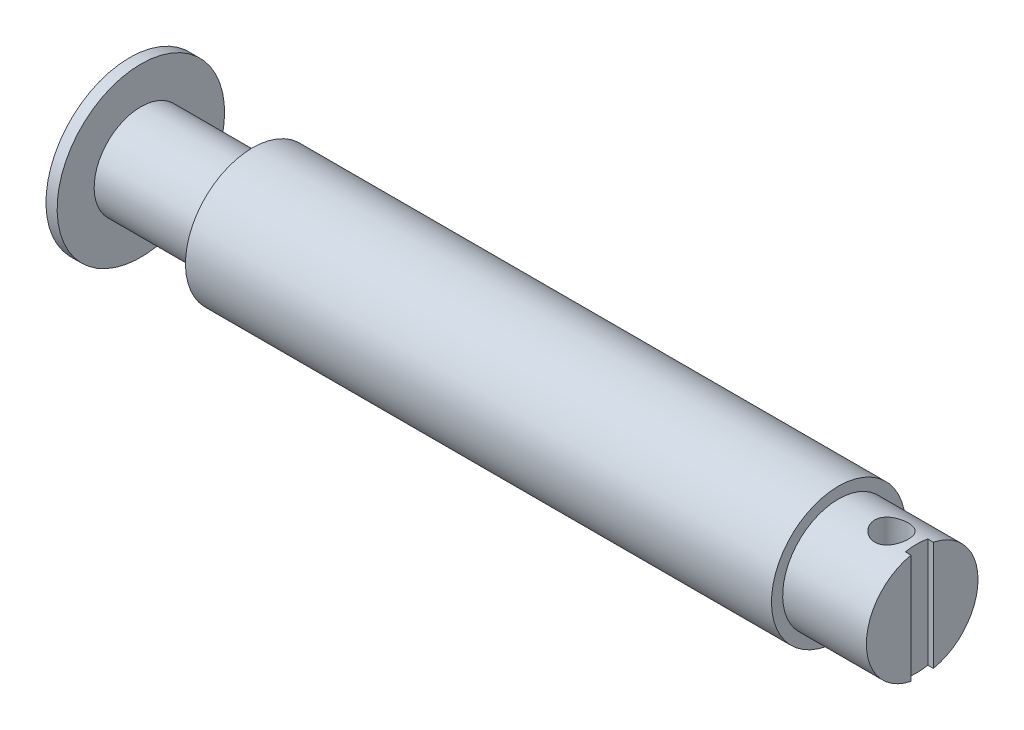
ISO-10303-21;
HEADER;
FILE_DESCRIPTION(('STEP AP214'),'2;1');
FILE_NAME('part.step','',(''),(''),'','','');
FILE_SCHEMA(('AUTOMOTIVE_DESIGN { 1 0 10303 214 1 1 1 1 }'));
ENDSEC;
DATA;
#1=APPLICATION_CONTEXT('core data for automotive mechanical design processes');
#2=APPLICATION_PROTOCOL_DEFINITION('international standard','automotive_design',2000,#1);
#3=PRODUCT_CONTEXT('',#1,'mechanical');
#4=PRODUCT('Part','Part','',(#3));
#5=PRODUCT_RELATED_PRODUCT_CATEGORY('part','',(#4));
#6=PRODUCT_DEFINITION_FORMATION('','',#4);
#7=PRODUCT_DEFINITION_CONTEXT('part definition',#1,'design');
#8=PRODUCT_DEFINITION('design','',#6,#7);
#9=PRODUCT_DEFINITION_SHAPE('','',#8);
#10=(LENGTH_UNIT() NAMED_UNIT(*) SI_UNIT(.MILLI.,.METRE.));
#11=(NAMED_UNIT(*) PLANE_ANGLE_UNIT() SI_UNIT($,.RADIAN.));
#12=(NAMED_UNIT(*) SI_UNIT($,.STERADIAN.) SOLID_ANGLE_UNIT());
#13=UNCERTAINTY_MEASURE_WITH_UNIT(LENGTH_MEASURE(1.E-05),#10,'distance_accuracy_value','');
#14=(GEOMETRIC_REPRESENTATION_CONTEXT(3) GLOBAL_UNCERTAINTY_ASSIGNED_CONTEXT((#13)) GLOBAL_UNIT_ASSIGNED_CONTEXT((#10,
#11,#12)) REPRESENTATION_CONTEXT('',''));
#15=CARTESIAN_POINT('',(0.,0.,0.));
#16=DIRECTION('',(0.,0.,1.));
#17=DIRECTION('',(1.,0.,0.));
#18=AXIS2_PLACEMENT_3D('',#15,#16,#17);
#19=CARTESIAN_POINT('',(87.,2.70021046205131E-13,0.));
#20=DIRECTION('',(1.,0.,0.));
#21=DIRECTION('',(0.,1.,0.));
#22=AXIS2_PLACEMENT_3D('',#19,#20,#21);
#23=PLANE('',#22);
#24=CARTESIAN_POINT('',(87.,2.70021046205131E-13,0.));
#25=DIRECTION('',(1.,0.,0.));
#26=DIRECTION('',(0.,1.,0.));
#27=AXIS2_PLACEMENT_3D('',#24,#25,#26);
#28=CIRCLE('',#27,9.99999999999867);
#29=CARTESIAN_POINT('',(87.,9.79795897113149,-2.));
#30=VERTEX_POINT('',#29);
#31=CARTESIAN_POINT('',(87.,9.79795897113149,2.));
#32=VERTEX_POINT('',#31);
#33=EDGE_CURVE('E102',#30,#32,#28,.T.);
#34=ORIENTED_EDGE('',*,*,#33,.T.);
#35=DIRECTION('',(0.,1.,0.));
#36=VECTOR('',#35,1.);
#37=CARTESIAN_POINT('',(87.,9.79795897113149,2.));
#38=LINE('',#37,#36);
#39=CARTESIAN_POINT('',(87.,-9.79795897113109,2.));
#40=VERTEX_POINT('',#39);
#41=EDGE_CURVE('E86',#40,#32,#38,.T.);
#42=ORIENTED_EDGE('',*,*,#41,.F.);
#43=CARTESIAN_POINT('',(87.,-9.79795897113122,-2.));
#44=VERTEX_POINT('',#43);
#45=EDGE_CURVE('E108',#40,#44,#28,.T.);
#46=ORIENTED_EDGE('',*,*,#45,.T.);
#47=DIRECTION('',(0.,1.,0.));
#48=VECTOR('',#47,1.);
#49=CARTESIAN_POINT('',(87.,-9.79795897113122,-2.));
#50=LINE('',#49,#48);
#51=EDGE_CURVE('E107',#44,#30,#50,.T.);
#52=ORIENTED_EDGE('',*,*,#51,.T.);
#53=EDGE_LOOP('',(#34,#42,#46,#52));
#54=FACE_BOUND('',#53,.T.);
#55=ADVANCED_FACE('F42',(#54),#23,.T.);
#56=CARTESIAN_POINT('',(73.,2.70616862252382E-13,0.));
#57=DIRECTION('',(1.,0.,0.));
#58=DIRECTION('',(0.,1.,0.));
#59=AXIS2_PLACEMENT_3D('',#56,#57,#58);
#60=PLANE('',#59);
#61=CARTESIAN_POINT('',(73.,2.70616862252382E-13,0.));
#62=DIRECTION('',(1.,0.,0.));
#63=DIRECTION('',(0.,1.,0.));
#64=AXIS2_PLACEMENT_3D('',#61,#62,#63);
#65=CIRCLE('',#64,12.);
#66=CARTESIAN_POINT('',(73.,12.0000000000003,0.));
#67=VERTEX_POINT('',#66);
#68=EDGE_CURVE('E137',#67,#67,#65,.T.);
#69=ORIENTED_EDGE('',*,*,#68,.T.);
#70=EDGE_LOOP('',(#69));
#71=FACE_BOUND('',#70,.T.);
#72=CARTESIAN_POINT('',(73.,2.70025701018E-13,0.));
#73=DIRECTION('',(1.,0.,0.));
#74=DIRECTION('',(0.,1.,0.));
#75=AXIS2_PLACEMENT_3D('',#72,#73,#74);
#76=CIRCLE('',#75,10.);
#77=CARTESIAN_POINT('',(73.,10.0000000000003,0.));
#78=VERTEX_POINT('',#77);
#79=EDGE_CURVE('E117',#78,#78,#76,.T.);
#80=ORIENTED_EDGE('',*,*,#79,.F.);
#81=EDGE_LOOP('',(#80));
#82=FACE_BOUND('',#81,.T.);
#83=ADVANCED_FACE('F166',(#71,#82),#60,.T.);
#84=CARTESIAN_POINT('',(-54.,2.70025701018E-13,0.));
#85=DIRECTION('',(1.,0.,0.));
#86=DIRECTION('',(0.,1.,0.));
#87=AXIS2_PLACEMENT_3D('',#84,#85,#86);
#88=CYLINDRICAL_SURFACE('',#87,15.);
#89=CARTESIAN_POINT('',(-54.,2.70025701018E-13,0.));
#90=DIRECTION('',(1.,0.,0.));
#91=DIRECTION('',(0.,1.,0.));
#92=AXIS2_PLACEMENT_3D('',#89,#90,#91);
#93=CIRCLE('',#92,15.);
#94=CARTESIAN_POINT('',(-54.,15.0000000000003,0.));
#95=VERTEX_POINT('',#94);
#96=EDGE_CURVE('E143',#95,#95,#93,.T.);
#97=ORIENTED_EDGE('',*,*,#96,.T.);
#98=EDGE_LOOP('',(#97));
#99=FACE_BOUND('',#98,.T.);
#100=CARTESIAN_POINT('',(-52.,2.70035010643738E-13,0.));
#101=DIRECTION('',(1.,0.,0.));
#102=DIRECTION('',(0.,1.,0.));
#103=AXIS2_PLACEMENT_3D('',#100,#101,#102);
#104=CIRCLE('',#103,15.);
#105=CARTESIAN_POINT('',(-52.,15.0000000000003,0.));
#106=VERTEX_POINT('',#105);
#107=EDGE_CURVE('E124',#106,#106,#104,.T.);
#108=ORIENTED_EDGE('',*,*,#107,.F.);
#109=EDGE_LOOP('',(#108));
#110=FACE_BOUND('',#109,.T.);
#111=ADVANCED_FACE('F44',(#99,#110),#88,.T.);
#112=CARTESIAN_POINT('',(-54.,15.0000000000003,0.));
#113=DIRECTION('',(-1.,0.,0.));
#114=DIRECTION('',(0.,-1.,0.));
#115=AXIS2_PLACEMENT_3D('',#112,#113,#114);
#116=PLANE('',#115);
#117=ORIENTED_EDGE('',*,*,#96,.F.);
#118=EDGE_LOOP('',(#117));
#119=FACE_BOUND('',#118,.T.);
#120=ADVANCED_FACE('F201',(#119),#116,.T.);
#121=CARTESIAN_POINT('',(-54.,2.70025701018E-13,0.));
#122=DIRECTION('',(1.,0.,0.));
#123=DIRECTION('',(0.,1.,0.));
#124=AXIS2_PLACEMENT_3D('',#121,#122,#123);
#125=CYLINDRICAL_SURFACE('',#124,12.);
#126=CARTESIAN_POINT('',(-32.,2.70128106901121E-13,0.));
#127=DIRECTION('',(1.,0.,0.));
#128=DIRECTION('',(0.,1.,0.));
#129=AXIS2_PLACEMENT_3D('',#126,#127,#128);
#130=CIRCLE('',#129,12.);
#131=CARTESIAN_POINT('',(-32.,12.0000000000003,0.));
#132=VERTEX_POINT('',#131);
#133=EDGE_CURVE('E132',#132,#132,#130,.T.);
#134=ORIENTED_EDGE('',*,*,#133,.T.);
#135=EDGE_LOOP('',(#134));
#136=FACE_BOUND('',#135,.T.);
#137=ORIENTED_EDGE('',*,*,#68,.F.);
#138=EDGE_LOOP('',(#137));
#139=FACE_BOUND('',#138,.T.);
#140=ADVANCED_FACE('F197',(#136,#139),#125,.T.);
#141=CARTESIAN_POINT('',(-32.,12.0000000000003,0.));
#142=DIRECTION('',(-1.,0.,0.));
#143=DIRECTION('',(0.,-1.,0.));
#144=AXIS2_PLACEMENT_3D('',#141,#142,#143);
#145=PLANE('',#144);
#146=CARTESIAN_POINT('',(-32.,2.70128106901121E-13,0.));
#147=DIRECTION('',(1.,0.,0.));
#148=DIRECTION('',(0.,1.,0.));
#149=AXIS2_PLACEMENT_3D('',#146,#147,#148);
#150=CIRCLE('',#149,8.36463737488);
#151=CARTESIAN_POINT('',(-32.,8.36463737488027,0.));
#152=VERTEX_POINT('',#151);
#153=EDGE_CURVE('E130',#152,#152,#150,.T.);
#154=ORIENTED_EDGE('',*,*,#153,.T.);
#155=EDGE_LOOP('',(#154));
#156=FACE_BOUND('',#155,.T.);
#157=ORIENTED_EDGE('',*,*,#133,.F.);
#158=EDGE_LOOP('',(#157));
#159=FACE_BOUND('',#158,.T.);
#160=ADVANCED_FACE('F190',(#156,#159),#145,.T.);
#161=CARTESIAN_POINT('',(-54.,2.70025701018E-13,0.));
#162=DIRECTION('',(1.,0.,0.));
#163=DIRECTION('',(0.,1.,0.));
#164=AXIS2_PLACEMENT_3D('',#161,#162,#163);
#165=CYLINDRICAL_SURFACE('',#164,8.36463737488);
#166=CARTESIAN_POINT('',(-52.,2.70035010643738E-13,0.));
#167=DIRECTION('',(1.,0.,0.));
#168=DIRECTION('',(0.,1.,0.));
#169=AXIS2_PLACEMENT_3D('',#166,#167,#168);
#170=CIRCLE('',#169,8.36463737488);
#171=CARTESIAN_POINT('',(-52.,8.36463737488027,0.));
#172=VERTEX_POINT('',#171);
#173=EDGE_CURVE('E127',#172,#172,#170,.T.);
#174=ORIENTED_EDGE('',*,*,#173,.T.);
#175=EDGE_LOOP('',(#174));
#176=FACE_BOUND('',#175,.T.);
#177=ORIENTED_EDGE('',*,*,#153,.F.);
#178=EDGE_LOOP('',(#177));
#179=FACE_BOUND('',#178,.T.);
#180=ADVANCED_FACE('F181',(#176,#179),#165,.T.);
#181=CARTESIAN_POINT('',(-52.,8.36463737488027,0.));
#182=DIRECTION('',(1.,0.,0.));
#183=DIRECTION('',(0.,1.,0.));
#184=AXIS2_PLACEMENT_3D('',#181,#182,#183);
#185=PLANE('',#184);
#186=ORIENTED_EDGE('',*,*,#107,.T.);
#187=EDGE_LOOP('',(#186));
#188=FACE_BOUND('',#187,.T.);
#189=ORIENTED_EDGE('',*,*,#173,.F.);
#190=EDGE_LOOP('',(#189));
#191=FACE_BOUND('',#190,.T.);
#192=ADVANCED_FACE('F174',(#188,#191),#185,.T.);
#193=CARTESIAN_POINT('',(88.,2.70095523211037E-13,0.));
#194=DIRECTION('',(-1.,0.,0.));
#195=DIRECTION('',(0.,-1.,0.));
#196=AXIS2_PLACEMENT_3D('',#193,#194,#195);
#197=CYLINDRICAL_SURFACE('',#196,10.);
#198=CARTESIAN_POINT('',(85.5,-9.99999999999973,0.));
#199=CARTESIAN_POINT('',(85.4999980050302,-9.99999858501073,-0.164577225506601));
#200=CARTESIAN_POINT('',(85.4864122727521,-9.9958983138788,-0.32917463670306));
#201=CARTESIAN_POINT('',(85.4325572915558,-9.97994211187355,-0.653576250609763));
#202=CARTESIAN_POINT('',(85.3922800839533,-9.96808386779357,-0.813379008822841));
#203=CARTESIAN_POINT('',(85.2865079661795,-9.93791105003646,-1.12346541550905));
#204=CARTESIAN_POINT('',(85.2210502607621,-9.91960600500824,-1.27376272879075));
#205=CARTESIAN_POINT('',(85.0669278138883,-9.87844218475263,-1.56124836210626));
#206=CARTESIAN_POINT('',(84.9782599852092,-9.85558280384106,-1.69843493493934));
#207=CARTESIAN_POINT('',(84.7775519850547,-9.80701474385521,-1.95974359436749));
#208=CARTESIAN_POINT('',(84.6649667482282,-9.78124767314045,-2.08343614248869));
#209=CARTESIAN_POINT('',(84.4207815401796,-9.73011668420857,-2.31049841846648));
#210=CARTESIAN_POINT('',(84.2891783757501,-9.70475283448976,-2.41386472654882));
#211=CARTESIAN_POINT('',(84.0070584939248,-9.65668227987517,-2.59960075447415));
#212=CARTESIAN_POINT('',(83.8561830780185,-9.63404813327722,-2.68144618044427));
#213=CARTESIAN_POINT('',(83.5420214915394,-9.59487240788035,-2.81842789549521));
#214=CARTESIAN_POINT('',(83.3787383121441,-9.57832936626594,-2.87357059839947));
#215=CARTESIAN_POINT('',(83.0492194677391,-9.55381741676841,-2.95403267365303));
#216=CARTESIAN_POINT('',(82.8831945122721,-9.5456213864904,-2.98014392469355));
#217=CARTESIAN_POINT('',(82.5489336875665,-9.53805579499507,-3.00427461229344));
#218=CARTESIAN_POINT('',(82.3806983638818,-9.53868409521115,-3.00230085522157));
#219=CARTESIAN_POINT('',(82.053232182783,-9.54849488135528,-2.97093954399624));
#220=CARTESIAN_POINT('',(81.8938954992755,-9.55736777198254,-2.94254410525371));
#221=CARTESIAN_POINT('',(81.5823604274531,-9.58216712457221,-2.86074840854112));
#222=CARTESIAN_POINT('',(81.4301627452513,-9.59809428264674,-2.80734568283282));
#223=CARTESIAN_POINT('',(81.1347993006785,-9.63545466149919,-2.67632053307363));
#224=CARTESIAN_POINT('',(80.9917858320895,-9.65696032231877,-2.59837633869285));
#225=CARTESIAN_POINT('',(80.7205359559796,-9.70301974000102,-2.42070445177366));
#226=CARTESIAN_POINT('',(80.5923031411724,-9.72757423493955,-2.32097148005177));
#227=CARTESIAN_POINT('',(80.348627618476,-9.77822022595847,-2.09762581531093));
#228=CARTESIAN_POINT('',(80.2339426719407,-9.80433308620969,-1.97318981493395));
#229=CARTESIAN_POINT('',(80.0268920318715,-9.8542448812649,-1.70652651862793));
#230=CARTESIAN_POINT('',(79.9345277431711,-9.87804367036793,-1.56429810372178));
#231=CARTESIAN_POINT('',(79.7742801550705,-9.92086320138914,-1.26471007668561));
#232=CARTESIAN_POINT('',(79.7065649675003,-9.93985087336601,-1.1072554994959));
#233=CARTESIAN_POINT('',(79.5988008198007,-9.97067043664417,-0.782490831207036));
#234=CARTESIAN_POINT('',(79.558744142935,-9.98250432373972,-0.61518350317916));
#235=CARTESIAN_POINT('',(79.5086956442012,-9.9973672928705,-0.281904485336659));
#236=CARTESIAN_POINT('',(79.4976768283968,-10.0006970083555,-0.11610019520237));
#237=CARTESIAN_POINT('',(79.5031383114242,-9.99905846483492,0.214999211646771));
#238=CARTESIAN_POINT('',(79.5196149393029,-9.99409131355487,0.380294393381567));
#239=CARTESIAN_POINT('',(79.578769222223,-9.97661393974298,0.701807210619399));
#240=CARTESIAN_POINT('',(79.6208467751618,-9.96427659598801,0.858145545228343));
#241=CARTESIAN_POINT('',(79.7292864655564,-9.93348695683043,1.16150927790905));
#242=CARTESIAN_POINT('',(79.7956515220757,-9.91503392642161,1.30853355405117));
#243=CARTESIAN_POINT('',(79.9525063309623,-9.87339308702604,1.59287437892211));
#244=CARTESIAN_POINT('',(80.043518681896,-9.85010561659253,1.72988765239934));
#245=CARTESIAN_POINT('',(80.2464495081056,-9.80146937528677,1.9870466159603));
#246=CARTESIAN_POINT('',(80.3583732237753,-9.77612008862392,2.10718806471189));
#247=CARTESIAN_POINT('',(80.6047746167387,-9.72506343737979,2.33171489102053));
#248=CARTESIAN_POINT('',(80.7399237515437,-9.69937650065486,2.43536962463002));
#249=CARTESIAN_POINT('',(81.0262558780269,-9.65153030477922,2.61857990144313));
#250=CARTESIAN_POINT('',(81.1774384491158,-9.62937095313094,2.69813607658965));
#251=CARTESIAN_POINT('',(81.4910649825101,-9.59134379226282,2.83034694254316));
#252=CARTESIAN_POINT('',(81.6534523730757,-9.57544675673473,2.88312693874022));
#253=CARTESIAN_POINT('',(81.9853759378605,-9.55183188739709,2.96043461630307));
#254=CARTESIAN_POINT('',(82.1549096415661,-9.5441112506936,2.98497197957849));
#255=CARTESIAN_POINT('',(82.4887230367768,-9.53799944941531,3.0044396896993));
#256=CARTESIAN_POINT('',(82.6529273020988,-9.53923294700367,3.00056110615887));
#257=CARTESIAN_POINT('',(82.9782282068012,-9.54998802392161,2.9661501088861));
#258=CARTESIAN_POINT('',(83.139324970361,-9.55950927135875,2.93561876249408));
#259=CARTESIAN_POINT('',(83.4518907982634,-9.58551527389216,2.84953777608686));
#260=CARTESIAN_POINT('',(83.6034545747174,-9.60191209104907,2.79430351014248));
#261=CARTESIAN_POINT('',(83.8952848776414,-9.63980557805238,2.66063014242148));
#262=CARTESIAN_POINT('',(84.0355492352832,-9.66130322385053,2.58218659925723));
#263=CARTESIAN_POINT('',(84.3063262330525,-9.70795352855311,2.40097527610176));
#264=CARTESIAN_POINT('',(84.4362975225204,-9.73321080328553,2.29742552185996));
#265=CARTESIAN_POINT('',(84.6774049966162,-9.78402640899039,2.07034869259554));
#266=CARTESIAN_POINT('',(84.7885362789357,-9.80958481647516,1.94681643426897));
#267=CARTESIAN_POINT('',(84.9920468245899,-9.85901873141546,1.67893152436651));
#268=CARTESIAN_POINT('',(85.083782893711,-9.88282319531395,1.53407577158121));
#269=CARTESIAN_POINT('',(85.2414703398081,-9.92521360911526,1.23028274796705));
#270=CARTESIAN_POINT('',(85.307433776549,-9.94380199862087,1.0713521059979));
#271=CARTESIAN_POINT('',(85.4057905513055,-9.97204349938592,0.761515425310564));
#272=CARTESIAN_POINT('',(85.4410233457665,-9.98244054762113,0.61157392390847));
#273=CARTESIAN_POINT('',(85.4881270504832,-9.99641888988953,0.30776039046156));
#274=CARTESIAN_POINT('',(85.5000018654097,-10.0000013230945,0.15388901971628));
#275=CARTESIAN_POINT('',(85.5,-9.99999999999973,0.));
#276=B_SPLINE_CURVE_WITH_KNOTS('',3,(#198,#199,#200,#201,#202,#203,#204,#205,#206,#207,#208,
#209,#210,#211,#212,#213,#214,#215,#216,#217,#218,#219,#220,#221,#222,#223,#224,#225,#226,#227,
#228,#229,#230,#231,#232,#233,#234,#235,#236,#237,#238,#239,#240,#241,#242,#243,#244,#245,#246,
#247,#248,#249,#250,#251,#252,#253,#254,#255,#256,#257,#258,#259,#260,#261,#262,#263,#264,#265,
#266,#267,#268,#269,#270,#271,#272,#273,#274,#275),.UNSPECIFIED.,.T.,.F.,(4,2,2,2,2,2,2,2,2,2,2,
2,2,2,2,2,2,2,2,2,2,2,2,2,2,2,2,2,2,2,2,2,2,2,2,2,2,2,4),(0.,0.493166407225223,0.986479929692,
1.47906735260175,1.97172032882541,2.47711205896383,2.98258874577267,3.49942962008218,
4.01614629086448,4.51839378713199,5.02051956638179,5.50452033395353,5.98856887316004,
6.4792485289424,6.97004720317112,7.48134208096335,7.99266913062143,8.50742093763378,
9.02202907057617,9.51817618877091,10.0142570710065,10.4991349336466,10.9840710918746,
11.4802261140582,11.9765056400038,12.4908080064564,13.0050968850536,13.5169562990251,
14.0286401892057,14.5190031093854,15.0093463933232,15.4936008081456,15.9779479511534,
16.4799385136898,16.9820594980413,17.4988599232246,18.0154182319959,18.4766338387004,
18.9377723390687),.UNSPECIFIED.);
#277=CARTESIAN_POINT('',(85.5,-9.99999999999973,0.));
#278=VERTEX_POINT('',#277);
#279=EDGE_CURVE('E12',#278,#278,#276,.T.);
#280=ORIENTED_EDGE('',*,*,#279,.T.);
#281=EDGE_LOOP('',(#280));
#282=FACE_BOUND('',#281,.T.);
#283=CARTESIAN_POINT('',(82.5,9.53939201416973,3.));
#284=CARTESIAN_POINT('',(82.3356109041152,9.53939371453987,2.99999795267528));
#285=CARTESIAN_POINT('',(82.171201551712,9.54368780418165,2.98644216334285));
#286=CARTESIAN_POINT('',(81.8471895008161,9.56033156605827,2.93271688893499));
#287=CARTESIAN_POINT('',(81.6875884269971,9.57268392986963,2.89253851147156));
#288=CARTESIAN_POINT('',(81.3779305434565,9.60392204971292,2.78705506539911));
#289=CARTESIAN_POINT('',(81.2278583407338,9.62279693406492,2.72179178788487));
#290=CARTESIAN_POINT('',(80.9407561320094,9.66493865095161,2.56812843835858));
#291=CARTESIAN_POINT('',(80.8037280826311,9.68820614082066,2.47972490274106));
#292=CARTESIAN_POINT('',(80.5422672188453,9.73733724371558,2.27929508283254));
#293=CARTESIAN_POINT('',(80.4183082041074,9.76325616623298,2.16666414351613));
#294=CARTESIAN_POINT('',(80.190724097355,9.81429723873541,1.9222724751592));
#295=CARTESIAN_POINT('',(80.0871016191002,9.83941928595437,1.79050929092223));
#296=CARTESIAN_POINT('',(79.9010746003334,9.88666429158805,1.50822287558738));
#297=CARTESIAN_POINT('',(79.8191531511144,9.90871448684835,1.35736804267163));
#298=CARTESIAN_POINT('',(79.6820254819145,9.94668871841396,1.04324929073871));
#299=CARTESIAN_POINT('',(79.6268135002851,9.96261407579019,0.879988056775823));
#300=CARTESIAN_POINT('',(79.546239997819,9.98615292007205,0.550647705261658));
#301=CARTESIAN_POINT('',(79.5200697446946,9.99399114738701,0.384782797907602));
#302=CARTESIAN_POINT('',(79.4957653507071,10.0012640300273,0.0508436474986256));
#303=CARTESIAN_POINT('',(79.4976253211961,10.000700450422,-0.117230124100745));
#304=CARTESIAN_POINT('',(79.528785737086,9.99139207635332,-0.445142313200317));
#305=CARTESIAN_POINT('',(79.5572103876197,9.98290840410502,-0.605072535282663));
#306=CARTESIAN_POINT('',(79.6392626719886,9.95903044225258,-0.917778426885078));
#307=CARTESIAN_POINT('',(79.6928919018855,9.94363571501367,-1.07055364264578));
#308=CARTESIAN_POINT('',(79.824424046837,9.90730441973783,-1.36669465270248));
#309=CARTESIAN_POINT('',(79.9026024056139,9.88630539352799,-1.50993012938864));
#310=CARTESIAN_POINT('',(80.080795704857,9.84099281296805,-1.78152934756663));
#311=CARTESIAN_POINT('',(80.1808158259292,9.8166784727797,-1.90988954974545));
#312=CARTESIAN_POINT('',(80.4043955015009,9.76623100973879,-2.15332096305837));
#313=CARTESIAN_POINT('',(80.5287138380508,9.7400639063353,-2.26768916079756));
#314=CARTESIAN_POINT('',(80.7950200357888,9.68967959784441,-2.47415303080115));
#315=CARTESIAN_POINT('',(80.937009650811,9.66546258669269,-2.56624648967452));
#316=CARTESIAN_POINT('',(81.2364789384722,9.6215580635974,-2.72627990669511));
#317=CARTESIAN_POINT('',(81.3940940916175,9.60191621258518,-2.79397978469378));
#318=CARTESIAN_POINT('',(81.7192144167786,9.56992784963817,-2.9016672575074));
#319=CARTESIAN_POINT('',(81.8867163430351,9.55757895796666,-2.94166389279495));
#320=CARTESIAN_POINT('',(82.2201647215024,9.54209699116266,-2.99149540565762));
#321=CARTESIAN_POINT('',(82.3859364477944,9.53863757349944,-3.00239892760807));
#322=CARTESIAN_POINT('',(82.7169458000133,9.54042384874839,-2.99671894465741));
#323=CARTESIAN_POINT('',(82.88218349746,9.54566832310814,-2.98013928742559));
#324=CARTESIAN_POINT('',(83.2029767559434,9.56395117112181,-2.92091527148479));
#325=CARTESIAN_POINT('',(83.3586723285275,9.57678353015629,-2.87895922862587));
#326=CARTESIAN_POINT('',(83.6608033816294,9.60858282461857,-2.77097155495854));
#327=CARTESIAN_POINT('',(83.807237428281,9.62755070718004,-2.70493620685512));
#328=CARTESIAN_POINT('',(84.0910349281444,9.67011670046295,-2.54863742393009));
#329=CARTESIAN_POINT('',(84.2280494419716,9.69382542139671,-2.4577712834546));
#330=CARTESIAN_POINT('',(84.4852762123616,9.74296411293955,-2.25510603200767));
#331=CARTESIAN_POINT('',(84.6054844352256,9.76839449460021,-2.14330191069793));
#332=CARTESIAN_POINT('',(84.8303608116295,9.81927267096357,-1.89691026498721));
#333=CARTESIAN_POINT('',(84.934271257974,9.84468490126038,-1.76162213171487));
#334=CARTESIAN_POINT('',(85.1179334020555,9.89169703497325,-1.4749235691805));
#335=CARTESIAN_POINT('',(85.1976862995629,9.9132971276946,-1.32351394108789));
#336=CARTESIAN_POINT('',(85.3300000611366,9.95011940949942,-1.00987100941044));
#337=CARTESIAN_POINT('',(85.382764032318,9.96538906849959,-0.847729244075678));
#338=CARTESIAN_POINT('',(85.4601218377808,9.9880395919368,-0.516339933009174));
#339=CARTESIAN_POINT('',(85.4847237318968,9.99542271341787,-0.347094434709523));
#340=CARTESIAN_POINT('',(85.504446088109,10.0013308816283,-0.0133043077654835));
#341=CARTESIAN_POINT('',(85.5006653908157,10.0001861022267,0.151170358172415));
#342=CARTESIAN_POINT('',(85.4663567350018,9.989945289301,0.47703896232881));
#343=CARTESIAN_POINT('',(85.4358302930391,9.98084970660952,0.638433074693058));
#344=CARTESIAN_POINT('',(85.3495766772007,9.9558233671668,0.951871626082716));
#345=CARTESIAN_POINT('',(85.294123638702,9.93996705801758,1.10399785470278));
#346=CARTESIAN_POINT('',(85.1598361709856,9.90305886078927,1.39686647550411));
#347=CARTESIAN_POINT('',(85.0809978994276,9.88200611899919,1.53760699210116));
#348=CARTESIAN_POINT('',(84.8992530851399,9.83607931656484,1.80860378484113));
#349=CARTESIAN_POINT('',(84.7956571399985,9.81110453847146,1.93838050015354));
#350=CARTESIAN_POINT('',(84.5685792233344,9.76047074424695,2.17907514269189));
#351=CARTESIAN_POINT('',(84.4450915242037,9.73481153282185,2.28998761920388));
#352=CARTESIAN_POINT('',(84.177318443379,9.68481361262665,2.49312538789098));
#353=CARTESIAN_POINT('',(84.0325228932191,9.66053705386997,2.58469519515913));
#354=CARTESIAN_POINT('',(83.728889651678,9.61705095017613,2.74208627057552));
#355=CARTESIAN_POINT('',(83.5700587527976,9.59783897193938,2.80791991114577));
#356=CARTESIAN_POINT('',(83.2605191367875,9.56855633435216,2.90603885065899));
#357=CARTESIAN_POINT('',(83.110782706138,9.55772309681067,2.94117718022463));
#358=CARTESIAN_POINT('',(82.8073695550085,9.5431408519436,2.98815637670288));
#359=CARTESIAN_POINT('',(82.6536936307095,9.53939042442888,3.00000191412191));
#360=CARTESIAN_POINT('',(82.5,9.53939201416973,3.));
#361=B_SPLINE_CURVE_WITH_KNOTS('',3,(#283,#284,#285,#286,#287,#288,#289,#290,#291,#292,#293,
#294,#295,#296,#297,#298,#299,#300,#301,#302,#303,#304,#305,#306,#307,#308,#309,#310,#311,#312,
#313,#314,#315,#316,#317,#318,#319,#320,#321,#322,#323,#324,#325,#326,#327,#328,#329,#330,#331,
#332,#333,#334,#335,#336,#337,#338,#339,#340,#341,#342,#343,#344,#345,#346,#347,#348,#349,#350,
#351,#352,#353,#354,#355,#356,#357,#358,#359,#360),.UNSPECIFIED.,.T.,.F.,(4,2,2,2,2,2,2,2,2,2,2,
2,2,2,2,2,2,2,2,2,2,2,2,2,2,2,2,2,2,2,2,2,2,2,2,2,2,2,4),(0.,0.492600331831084,
0.985365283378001,1.4773128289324,1.96933405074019,2.47546300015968,2.98165695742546,
3.49831878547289,4.01486911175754,4.51664280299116,5.01831108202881,5.50400251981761,
5.98972471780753,6.48110418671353,6.97260033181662,7.48304294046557,7.99353624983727,
8.50892476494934,9.02414501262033,9.52016161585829,10.0161087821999,10.4991718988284,
10.9823096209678,11.4784146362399,11.9746385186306,12.4895901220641,13.0045161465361,
13.5155078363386,14.0263532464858,14.5175260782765,15.0086710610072,15.4945419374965,
15.9804926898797,16.4819925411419,16.9836370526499,17.5002327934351,18.016579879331,
18.4772230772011,18.9377739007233),.UNSPECIFIED.);
#362=CARTESIAN_POINT('',(82.5,9.53939201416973,3.));
#363=VERTEX_POINT('',#362);
#364=EDGE_CURVE('E54',#363,#363,#361,.T.);
#365=ORIENTED_EDGE('',*,*,#364,.T.);
#366=EDGE_LOOP('',(#365));
#367=FACE_BOUND('',#366,.T.);
#368=CARTESIAN_POINT('',(88.,2.70095523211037E-13,0.));
#369=DIRECTION('',(1.,0.,0.));
#370=DIRECTION('',(0.,1.,0.));
#371=AXIS2_PLACEMENT_3D('',#368,#369,#370);
#372=CIRCLE('',#371,10.);
#373=CARTESIAN_POINT('',(88.,-9.79795897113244,-2.));
#374=VERTEX_POINT('',#373);
#375=CARTESIAN_POINT('',(88.,9.79795897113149,-2.));
#376=VERTEX_POINT('',#375);
#377=EDGE_CURVE('E121',#374,#376,#372,.T.);
#378=ORIENTED_EDGE('',*,*,#377,.F.);
#379=DIRECTION('',(1.,0.,0.));
#380=VECTOR('',#379,1.);
#381=CARTESIAN_POINT('',(87.,-9.79795897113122,-2.));
#382=LINE('',#381,#380);
#383=EDGE_CURVE('E69',#44,#374,#382,.T.);
#384=ORIENTED_EDGE('',*,*,#383,.F.);
#385=ORIENTED_EDGE('',*,*,#45,.F.);
#386=DIRECTION('',(-1.,0.,0.));
#387=VECTOR('',#386,1.);
#388=CARTESIAN_POINT('',(88.,-9.79795897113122,2.));
#389=LINE('',#388,#387);
#390=CARTESIAN_POINT('',(88.,-9.79795897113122,2.));
#391=VERTEX_POINT('',#390);
#392=EDGE_CURVE('E61',#391,#40,#389,.T.);
#393=ORIENTED_EDGE('',*,*,#392,.F.);
#394=CARTESIAN_POINT('',(88.,2.70030355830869E-13,0.));
#395=DIRECTION('',(1.,0.,0.));
#396=DIRECTION('',(0.,-1.,0.));
#397=AXIS2_PLACEMENT_3D('',#394,#395,#396);
#398=CIRCLE('',#397,9.99999999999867);
#399=CARTESIAN_POINT('',(88.,9.79795897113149,2.));
#400=VERTEX_POINT('',#399);
#401=EDGE_CURVE('E94',#400,#391,#398,.T.);
#402=ORIENTED_EDGE('',*,*,#401,.F.);
#403=DIRECTION('',(-1.,0.,0.));
#404=VECTOR('',#403,1.);
#405=CARTESIAN_POINT('',(88.,9.79795897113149,2.));
#406=LINE('',#405,#404);
#407=EDGE_CURVE('E89',#400,#32,#406,.T.);
#408=ORIENTED_EDGE('',*,*,#407,.T.);
#409=ORIENTED_EDGE('',*,*,#33,.F.);
#410=DIRECTION('',(1.,0.,0.));
#411=VECTOR('',#410,1.);
#412=CARTESIAN_POINT('',(87.,9.79795897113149,-2.));
#413=LINE('',#412,#411);
#414=EDGE_CURVE('E115',#30,#376,#413,.T.);
#415=ORIENTED_EDGE('',*,*,#414,.T.);
#416=EDGE_LOOP('',(#378,#384,#385,#393,#402,#408,#409,#415));
#417=FACE_BOUND('',#416,.T.);
#418=ORIENTED_EDGE('',*,*,#79,.T.);
#419=EDGE_LOOP('',(#418));
#420=FACE_BOUND('',#419,.T.);
#421=ADVANCED_FACE('F99',(#282,#367,#417,#420),#197,.T.);
#422=CARTESIAN_POINT('',(88.,2.70095523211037E-13,0.));
#423=DIRECTION('',(1.,0.,0.));
#424=DIRECTION('',(0.,1.,0.));
#425=AXIS2_PLACEMENT_3D('',#422,#423,#424);
#426=PLANE('',#425);
#427=DIRECTION('',(0.,1.,0.));
#428=VECTOR('',#427,1.);
#429=CARTESIAN_POINT('',(88.,-9.79795897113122,-2.));
#430=LINE('',#429,#428);
#431=EDGE_CURVE('E111',#374,#376,#430,.T.);
#432=ORIENTED_EDGE('',*,*,#431,.F.);
#433=ORIENTED_EDGE('',*,*,#377,.T.);
#434=EDGE_LOOP('',(#432,#433));
#435=FACE_BOUND('',#434,.T.);
#436=ADVANCED_FACE('F168',(#435),#426,.T.);
#437=CARTESIAN_POINT('',(87.,-9.79795897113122,-2.));
#438=DIRECTION('',(0.,0.,-1.));
#439=DIRECTION('',(-1.,0.,0.));
#440=AXIS2_PLACEMENT_3D('',#437,#438,#439);
#441=PLANE('',#440);
#442=ORIENTED_EDGE('',*,*,#431,.T.);
#443=ORIENTED_EDGE('',*,*,#414,.F.);
#444=ORIENTED_EDGE('',*,*,#51,.F.);
#445=ORIENTED_EDGE('',*,*,#383,.T.);
#446=EDGE_LOOP('',(#442,#443,#444,#445));
#447=FACE_BOUND('',#446,.T.);
#448=ADVANCED_FACE('F163',(#447),#441,.F.);
#449=CARTESIAN_POINT('',(88.,9.79795897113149,2.));
#450=DIRECTION('',(0.,0.,1.));
#451=DIRECTION('',(1.,0.,0.));
#452=AXIS2_PLACEMENT_3D('',#449,#450,#451);
#453=PLANE('',#452);
#454=ORIENTED_EDGE('',*,*,#41,.T.);
#455=ORIENTED_EDGE('',*,*,#407,.F.);
#456=DIRECTION('',(0.,1.,0.));
#457=VECTOR('',#456,1.);
#458=CARTESIAN_POINT('',(88.,9.79795897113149,2.));
#459=LINE('',#458,#457);
#460=EDGE_CURVE('E104',#391,#400,#459,.T.);
#461=ORIENTED_EDGE('',*,*,#460,.F.);
#462=ORIENTED_EDGE('',*,*,#392,.T.);
#463=EDGE_LOOP('',(#454,#455,#461,#462));
#464=FACE_BOUND('',#463,.T.);
#465=ADVANCED_FACE('F88',(#464),#453,.F.);
#466=CARTESIAN_POINT('',(88.,2.70030355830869E-13,0.));
#467=DIRECTION('',(-1.,0.,0.));
#468=DIRECTION('',(0.,-1.,0.));
#469=AXIS2_PLACEMENT_3D('',#466,#467,#468);
#470=PLANE('',#469);
#471=ORIENTED_EDGE('',*,*,#401,.T.);
#472=ORIENTED_EDGE('',*,*,#460,.T.);
#473=EDGE_LOOP('',(#471,#472));
#474=FACE_BOUND('',#473,.T.);
#475=ADVANCED_FACE('F155',(#474),#470,.F.);
#476=CARTESIAN_POINT('',(82.5,-9.99999999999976,0.));
#477=DIRECTION('',(0.,1.,0.));
#478=DIRECTION('',(0.,0.,1.));
#479=AXIS2_PLACEMENT_3D('',#476,#477,#478);
#480=CYLINDRICAL_SURFACE('',#479,3.);
#481=ORIENTED_EDGE('',*,*,#364,.F.);
#482=EDGE_LOOP('',(#481));
#483=FACE_BOUND('',#482,.T.);
#484=ORIENTED_EDGE('',*,*,#279,.F.);
#485=EDGE_LOOP('',(#484));
#486=FACE_BOUND('',#485,.T.);
#487=ADVANCED_FACE('F151',(#483,#486),#480,.F.);
#488=CLOSED_SHELL('',(#55,#83,#111,#120,#140,#160,#180,#192,#421,#436,#448,#465,#475,#487));
#489=MANIFOLD_SOLID_BREP('B2',#488);
#490=ADVANCED_BREP_SHAPE_REPRESENTATION('',(#18,#489),#14);
#491=SHAPE_DEFINITION_REPRESENTATION(#9,#490);
ENDSEC;
END-ISO-10303-21;
